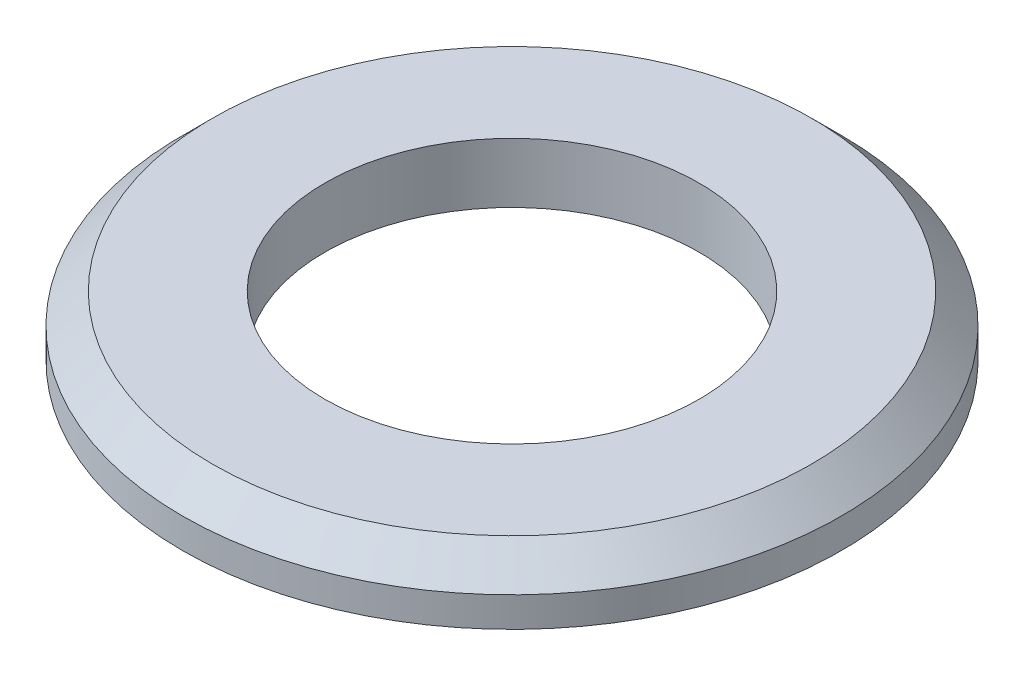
ISO-10303-21;
HEADER;
FILE_DESCRIPTION(('STEP AP214'),'2;1');
FILE_NAME('part.step','',(''),(''),'','','');
FILE_SCHEMA(('AUTOMOTIVE_DESIGN { 1 0 10303 214 1 1 1 1 }'));
ENDSEC;
DATA;
#1=APPLICATION_CONTEXT('core data for automotive mechanical design processes');
#2=APPLICATION_PROTOCOL_DEFINITION('international standard','automotive_design',2000,#1);
#3=PRODUCT_CONTEXT('',#1,'mechanical');
#4=PRODUCT('Part','Part','',(#3));
#5=PRODUCT_RELATED_PRODUCT_CATEGORY('part','',(#4));
#6=PRODUCT_DEFINITION_FORMATION('','',#4);
#7=PRODUCT_DEFINITION_CONTEXT('part definition',#1,'design');
#8=PRODUCT_DEFINITION('design','',#6,#7);
#9=PRODUCT_DEFINITION_SHAPE('','',#8);
#10=(LENGTH_UNIT() NAMED_UNIT(*) SI_UNIT(.MILLI.,.METRE.));
#11=(NAMED_UNIT(*) PLANE_ANGLE_UNIT() SI_UNIT($,.RADIAN.));
#12=(NAMED_UNIT(*) SI_UNIT($,.STERADIAN.) SOLID_ANGLE_UNIT());
#13=UNCERTAINTY_MEASURE_WITH_UNIT(LENGTH_MEASURE(1.E-05),#10,'distance_accuracy_value','');
#14=(GEOMETRIC_REPRESENTATION_CONTEXT(3) GLOBAL_UNCERTAINTY_ASSIGNED_CONTEXT((#13)) GLOBAL_UNIT_ASSIGNED_CONTEXT((#10,
#11,#12)) REPRESENTATION_CONTEXT('',''));
#15=CARTESIAN_POINT('',(0.,0.,0.));
#16=DIRECTION('',(0.,0.,1.));
#17=DIRECTION('',(1.,0.,0.));
#18=AXIS2_PLACEMENT_3D('',#15,#16,#17);
#19=CARTESIAN_POINT('',(0.,4.,0.));
#20=DIRECTION('',(0.,1.,0.));
#21=DIRECTION('',(0.,0.,1.));
#22=AXIS2_PLACEMENT_3D('',#19,#20,#21);
#23=PLANE('',#22);
#24=CARTESIAN_POINT('',(0.,4.,0.));
#25=DIRECTION('',(0.,1.,0.));
#26=DIRECTION('',(0.,0.,1.));
#27=AXIS2_PLACEMENT_3D('',#24,#25,#26);
#28=CIRCLE('',#27,20.);
#29=CARTESIAN_POINT('',(0.,4.,20.));
#30=VERTEX_POINT('',#29);
#31=EDGE_CURVE('E35',#30,#30,#28,.T.);
#32=ORIENTED_EDGE('',*,*,#31,.T.);
#33=EDGE_LOOP('',(#32));
#34=FACE_BOUND('',#33,.T.);
#35=CARTESIAN_POINT('',(0.,4.,0.));
#36=DIRECTION('',(0.,1.,0.));
#37=DIRECTION('',(0.,0.,1.));
#38=AXIS2_PLACEMENT_3D('',#35,#36,#37);
#39=CIRCLE('',#38,12.5);
#40=CARTESIAN_POINT('',(0.,4.,12.5));
#41=VERTEX_POINT('',#40);
#42=EDGE_CURVE('E43',#41,#41,#39,.T.);
#43=ORIENTED_EDGE('',*,*,#42,.F.);
#44=EDGE_LOOP('',(#43));
#45=FACE_BOUND('',#44,.T.);
#46=ADVANCED_FACE('F28',(#34,#45),#23,.T.);
#47=CARTESIAN_POINT('',(0.,0.,0.));
#48=DIRECTION('',(0.,1.,0.));
#49=DIRECTION('',(0.,0.,1.));
#50=AXIS2_PLACEMENT_3D('',#47,#48,#49);
#51=PLANE('',#50);
#52=CARTESIAN_POINT('',(0.,0.,0.));
#53=DIRECTION('',(0.,1.,0.));
#54=DIRECTION('',(0.,0.,1.));
#55=AXIS2_PLACEMENT_3D('',#52,#53,#54);
#56=CIRCLE('',#55,22.);
#57=CARTESIAN_POINT('',(0.,0.,22.));
#58=VERTEX_POINT('',#57);
#59=EDGE_CURVE('E39',#58,#58,#56,.T.);
#60=ORIENTED_EDGE('',*,*,#59,.F.);
#61=EDGE_LOOP('',(#60));
#62=FACE_BOUND('',#61,.T.);
#63=CARTESIAN_POINT('',(0.,0.,0.));
#64=DIRECTION('',(0.,1.,0.));
#65=DIRECTION('',(0.,0.,1.));
#66=AXIS2_PLACEMENT_3D('',#63,#64,#65);
#67=CIRCLE('',#66,12.5);
#68=CARTESIAN_POINT('',(0.,0.,12.5));
#69=VERTEX_POINT('',#68);
#70=EDGE_CURVE('E48',#69,#69,#67,.T.);
#71=ORIENTED_EDGE('',*,*,#70,.T.);
#72=EDGE_LOOP('',(#71));
#73=FACE_BOUND('',#72,.T.);
#74=ADVANCED_FACE('F52',(#62,#73),#51,.F.);
#75=CARTESIAN_POINT('',(0.,4.,0.));
#76=DIRECTION('',(0.,-1.,0.));
#77=DIRECTION('',(0.,0.,-1.));
#78=AXIS2_PLACEMENT_3D('',#75,#76,#77);
#79=CYLINDRICAL_SURFACE('',#78,22.);
#80=CARTESIAN_POINT('',(0.,2.00000000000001,0.));
#81=DIRECTION('',(0.,1.,0.));
#82=DIRECTION('',(0.,0.,1.));
#83=AXIS2_PLACEMENT_3D('',#80,#81,#82);
#84=CIRCLE('',#83,22.);
#85=CARTESIAN_POINT('',(0.,2.00000000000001,22.));
#86=VERTEX_POINT('',#85);
#87=EDGE_CURVE('E10',#86,#86,#84,.F.);
#88=ORIENTED_EDGE('',*,*,#87,.T.);
#89=EDGE_LOOP('',(#88));
#90=FACE_BOUND('',#89,.T.);
#91=ORIENTED_EDGE('',*,*,#59,.T.);
#92=EDGE_LOOP('',(#91));
#93=FACE_BOUND('',#92,.T.);
#94=ADVANCED_FACE('F30',(#90,#93),#79,.T.);
#95=CARTESIAN_POINT('',(0.,4.,0.));
#96=DIRECTION('',(0.,-1.,0.));
#97=DIRECTION('',(0.,0.,-1.));
#98=AXIS2_PLACEMENT_3D('',#95,#96,#97);
#99=CYLINDRICAL_SURFACE('',#98,12.5);
#100=ORIENTED_EDGE('',*,*,#42,.T.);
#101=EDGE_LOOP('',(#100));
#102=FACE_BOUND('',#101,.T.);
#103=ORIENTED_EDGE('',*,*,#70,.F.);
#104=EDGE_LOOP('',(#103));
#105=FACE_BOUND('',#104,.T.);
#106=ADVANCED_FACE('F54',(#102,#105),#99,.F.);
#107=CARTESIAN_POINT('',(0.,4.,0.));
#108=DIRECTION('',(0.,-1.,0.));
#109=DIRECTION('',(0.,0.,-1.));
#110=AXIS2_PLACEMENT_3D('',#107,#108,#109);
#111=CONICAL_SURFACE('',#110,20.,0.78539816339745);
#112=ORIENTED_EDGE('',*,*,#87,.F.);
#113=EDGE_LOOP('',(#112));
#114=FACE_BOUND('',#113,.T.);
#115=ORIENTED_EDGE('',*,*,#31,.F.);
#116=EDGE_LOOP('',(#115));
#117=FACE_BOUND('',#116,.T.);
#118=ADVANCED_FACE('F56',(#114,#117),#111,.T.);
#119=CLOSED_SHELL('',(#46,#74,#94,#106,#118));
#120=MANIFOLD_SOLID_BREP('B2',#119);
#121=ADVANCED_BREP_SHAPE_REPRESENTATION('',(#18,#120),#14);
#122=SHAPE_DEFINITION_REPRESENTATION(#9,#121);
ENDSEC;
END-ISO-10303-21;
